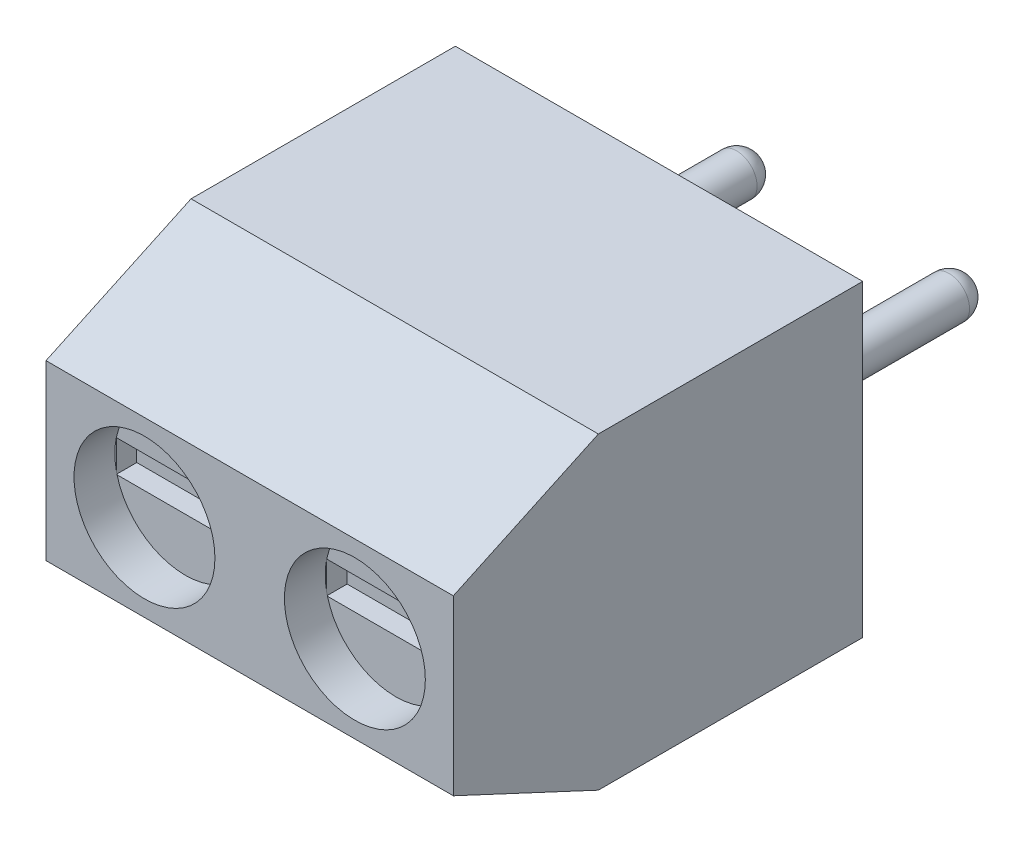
from build123d import *
from OCP.BRepFilletAPI import BRepFilletAPI_MakeChamfer

# Parameters (mm, degrees)
ESQUISSE1_W             = 9.97
ESQUISSE1_H             = 7.55
EXTRUSION1_DEPTH        = 10.02
CHANFREIN1_SIZE         = 3.55
CHANFREIN1_SIZE2        = 1.655392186
ESQUISSE2_R             = 1.725
ENL_V_MAT_EXTRU_1_DEPTH = 1
ESQUISSE3_W             = 4
ESQUISSE3_H             = 5
ENL_V_MAT_EXTRU_2_DEPTH = 1.6
ESQUISSE4_R             = 1.675
ENL_V_MAT_EXTRU_3_DEPTH = 1.6
ESQUISSE5_R             = 0.5
EXTRUSION2_DEPTH        = 5
CONG_1_R                = 0.5
ESQUISSE7_W             = 3.359641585
ESQUISSE7_H             = 0.780050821
ENL_V_MAT_EXTRU_4_DEPTH = 0.5
ESQUISSE8_W             = 3.1960084
ESQUISSE8_H             = 1.003036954
ENL_V_MAT_EXTRU_5_DEPTH = 0.5


with BuildPart() as part:
    # Esquisse1 → Extrusion1 (new body)
    with BuildSketch(Plane.XY):
        with Locations((4.985, 3.775)):
            Rectangle(ESQUISSE1_W, ESQUISSE1_H)
    extrude(amount=EXTRUSION1_DEPTH)

    # Chanfrein1: one chamfer whose edges measure the first distance from different faces: ONE call of the kernel's chamfer builder (chamfer() names one face for all edges)
    chanfrein1_edges_1 = [part.edges().sort_by_distance(p)[0] for p in [
        (4.985, 7.55, 10.02),
    ]]
    chanfrein1_side_1 = [part.faces().sort_by_distance(p)[0] for p in [
        (4.985, 7.55, 5.01),
    ]]
    chanfrein1_edges_2 = [part.edges().sort_by_distance(p)[0] for p in [
        (4.985, 0, 10.02),
    ]]
    chanfrein1_side_2 = [part.faces().sort_by_distance(p)[0] for p in [
        (4.985, 0, 5.01),
    ]]
    chanfrein1 = BRepFilletAPI_MakeChamfer(part.part.solid().wrapped)
    for e in chanfrein1_edges_1:
        chanfrein1.Add(CHANFREIN1_SIZE, CHANFREIN1_SIZE2, e.wrapped, chanfrein1_side_1[0].wrapped)  # the first distance lies on this face
    for e in chanfrein1_edges_2:
        chanfrein1.Add(CHANFREIN1_SIZE, CHANFREIN1_SIZE2, e.wrapped, chanfrein1_side_2[0].wrapped)  # the first distance lies on this face
    add(Compound.cast(chanfrein1.Shape()), mode=Mode.REPLACE)

    # Esquisse2 → Enl_v. mat.-Extru.1 (cut)
    with BuildSketch(Plane.XY.offset(10.02)):
        with Locations((2.410120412, 3.775)):
            Circle(ESQUISSE2_R)
        with Locations((7.559879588, 3.775)):
            Circle(ESQUISSE2_R)
    extrude(amount=-ENL_V_MAT_EXTRU_1_DEPTH, mode=Mode.SUBTRACT)

    # Esquisse3 → Enl_v. mat.-Extru.2 (cut)
    with BuildSketch(Plane.XZ):
        with Locations((7.435, 3.3)):
            Rectangle(ESQUISSE3_W, ESQUISSE3_H)
        with Locations((2.535, 3.3)):
            Rectangle(ESQUISSE3_W, ESQUISSE3_H)
    extrude(amount=-ENL_V_MAT_EXTRU_2_DEPTH, mode=Mode.SUBTRACT)

    # Esquisse4 → Enl_v. mat.-Extru.3 (cut)
    with BuildSketch(Plane.XZ.offset(-1.6)):
        with Locations(Location((7.435, 3.235, 0), (0, 0, 270))):
            Circle(ESQUISSE4_R)
        with Locations(Location((2.535, 3.235, 0), (0, 0, 270))):
            Circle(ESQUISSE4_R)
    extrude(amount=-ENL_V_MAT_EXTRU_3_DEPTH, mode=Mode.SUBTRACT)

    # Esquisse5 → Extrusion2 (add)
    with BuildSketch(Plane(origin=(0, 0, 0), x_dir=(-1, 0, 0), z_dir=(0, 0, -1))):
        with Locations((-7.585, 3.775)):
            Circle(ESQUISSE5_R)
        with Locations((-2.385, 3.775)):
            Circle(ESQUISSE5_R)
    extrude(amount=EXTRUSION2_DEPTH)

    # Cong_1
    cong_1_edges = [part.edges().sort_by_distance(p)[0] for p in [
        (8.085, 3.775, -5),
        (2.885, 3.775, -5),
    ]]
    fillet(cong_1_edges, radius=CONG_1_R)

    # Esquisse7 → Enl_v. mat.-Extru.4 (cut)
    with BuildSketch(Plane.XY.offset(9.02)):
        with Locations((2.40077537, 3.734751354)):
            Rectangle(ESQUISSE7_W, ESQUISSE7_H)
        with Locations((7.550534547, 3.734751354)):
            Rectangle(ESQUISSE7_W, ESQUISSE7_H)
    extrude(amount=-ENL_V_MAT_EXTRU_4_DEPTH, mode=Mode.SUBTRACT)

    # Esquisse8 → Enl_v. mat.-Extru.5 (cut)
    with BuildSketch(Plane.XZ.offset(-3.2)):
        with Locations((2.54160667, 3.256051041)):
            Rectangle(ESQUISSE8_W, ESQUISSE8_H)
        with Locations((7.44160667, 3.256051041)):
            Rectangle(ESQUISSE8_W, ESQUISSE8_H)
    extrude(amount=-ENL_V_MAT_EXTRU_5_DEPTH, mode=Mode.SUBTRACT)


solid = part.part
